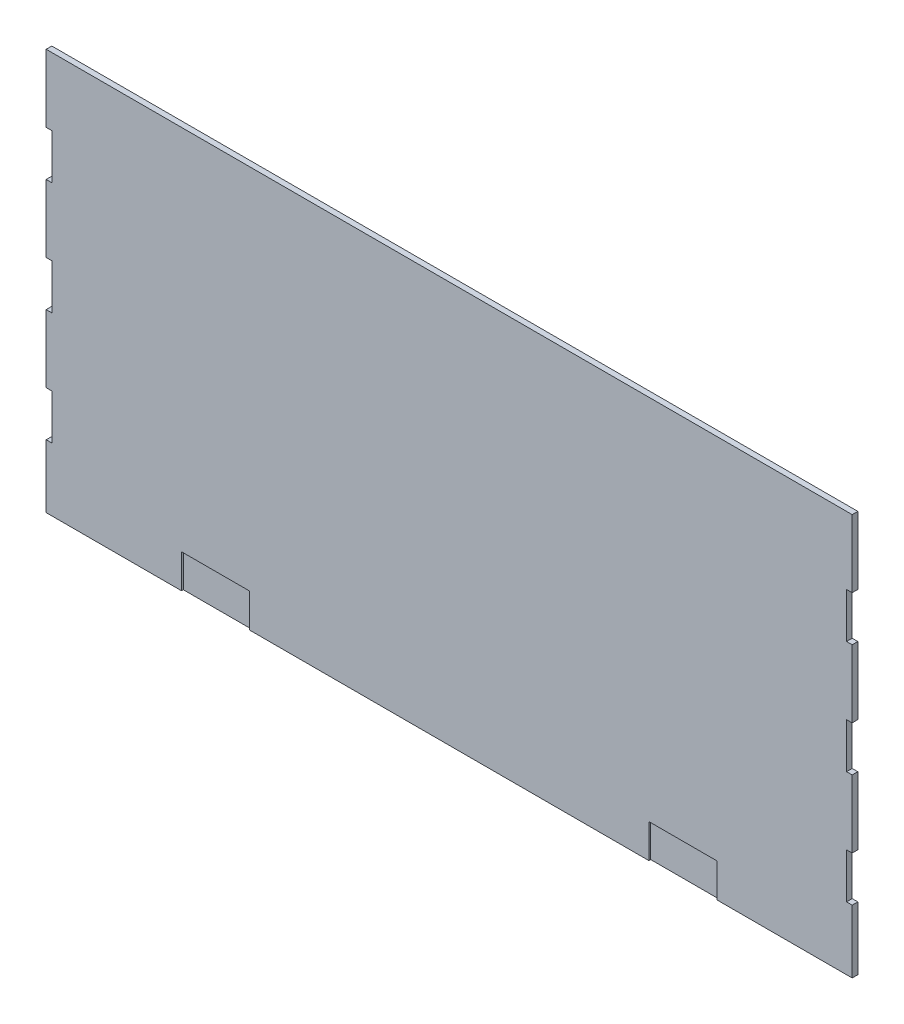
ISO-10303-21;
HEADER;
FILE_DESCRIPTION(('STEP AP214'),'2;1');
FILE_NAME('part.step','',(''),(''),'','','');
FILE_SCHEMA(('AUTOMOTIVE_DESIGN { 1 0 10303 214 1 1 1 1 }'));
ENDSEC;
DATA;
#1=APPLICATION_CONTEXT('core data for automotive mechanical design processes');
#2=APPLICATION_PROTOCOL_DEFINITION('international standard','automotive_design',2000,#1);
#3=PRODUCT_CONTEXT('',#1,'mechanical');
#4=PRODUCT('Part','Part','',(#3));
#5=PRODUCT_RELATED_PRODUCT_CATEGORY('part','',(#4));
#6=PRODUCT_DEFINITION_FORMATION('','',#4);
#7=PRODUCT_DEFINITION_CONTEXT('part definition',#1,'design');
#8=PRODUCT_DEFINITION('design','',#6,#7);
#9=PRODUCT_DEFINITION_SHAPE('','',#8);
#10=(LENGTH_UNIT() NAMED_UNIT(*) SI_UNIT(.MILLI.,.METRE.));
#11=(NAMED_UNIT(*) PLANE_ANGLE_UNIT() SI_UNIT($,.RADIAN.));
#12=(NAMED_UNIT(*) SI_UNIT($,.STERADIAN.) SOLID_ANGLE_UNIT());
#13=UNCERTAINTY_MEASURE_WITH_UNIT(LENGTH_MEASURE(1.E-05),#10,'distance_accuracy_value','');
#14=(GEOMETRIC_REPRESENTATION_CONTEXT(3) GLOBAL_UNCERTAINTY_ASSIGNED_CONTEXT((#13)) GLOBAL_UNIT_ASSIGNED_CONTEXT((#10,
#11,#12)) REPRESENTATION_CONTEXT('',''));
#15=CARTESIAN_POINT('',(0.,0.,0.));
#16=DIRECTION('',(0.,0.,1.));
#17=DIRECTION('',(1.,0.,0.));
#18=AXIS2_PLACEMENT_3D('',#15,#16,#17);
#19=CARTESIAN_POINT('',(0.,0.,3.175));
#20=DIRECTION('',(1.,0.,0.));
#21=DIRECTION('',(0.,0.,-1.));
#22=AXIS2_PLACEMENT_3D('',#19,#20,#21);
#23=PLANE('',#22);
#24=DIRECTION('',(0.,-1.,0.));
#25=VECTOR('',#24,1.);
#26=CARTESIAN_POINT('',(0.,0.,0.));
#27=LINE('',#26,#25);
#28=CARTESIAN_POINT('',(0.,35.56,0.));
#29=VERTEX_POINT('',#28);
#30=CARTESIAN_POINT('',(0.,0.,0.));
#31=VERTEX_POINT('',#30);
#32=EDGE_CURVE('E329',#29,#31,#27,.T.);
#33=ORIENTED_EDGE('',*,*,#32,.T.);
#34=DIRECTION('',(0.,0.,-1.));
#35=VECTOR('',#34,1.);
#36=CARTESIAN_POINT('',(0.,0.,3.175));
#37=LINE('',#36,#35);
#38=CARTESIAN_POINT('',(0.,0.,3.175));
#39=VERTEX_POINT('',#38);
#40=EDGE_CURVE('E11',#39,#31,#37,.T.);
#41=ORIENTED_EDGE('',*,*,#40,.F.);
#42=DIRECTION('',(0.,-1.,0.));
#43=VECTOR('',#42,1.);
#44=CARTESIAN_POINT('',(0.,0.,3.175));
#45=LINE('',#44,#43);
#46=CARTESIAN_POINT('',(0.,35.56,3.175));
#47=VERTEX_POINT('',#46);
#48=EDGE_CURVE('E335',#47,#39,#45,.T.);
#49=ORIENTED_EDGE('',*,*,#48,.F.);
#50=DIRECTION('',(0.,0.,-1.));
#51=VECTOR('',#50,1.);
#52=CARTESIAN_POINT('',(0.,35.56,3.175));
#53=LINE('',#52,#51);
#54=EDGE_CURVE('E396',#47,#29,#53,.T.);
#55=ORIENTED_EDGE('',*,*,#54,.T.);
#56=EDGE_LOOP('',(#33,#41,#49,#55));
#57=FACE_BOUND('',#56,.T.);
#58=ADVANCED_FACE('F35',(#57),#23,.F.);
#59=CARTESIAN_POINT('',(0.,0.,3.175));
#60=DIRECTION('',(0.,1.,0.));
#61=DIRECTION('',(-1.,0.,0.));
#62=AXIS2_PLACEMENT_3D('',#59,#60,#61);
#63=PLANE('',#62);
#64=DIRECTION('',(1.,0.,0.));
#65=VECTOR('',#64,1.);
#66=CARTESIAN_POINT('',(339.471,0.,2.159));
#67=LINE('',#66,#65);
#68=CARTESIAN_POINT('',(339.471,0.,2.159));
#69=VERTEX_POINT('',#68);
#70=CARTESIAN_POINT('',(377.825,0.,2.159));
#71=VERTEX_POINT('',#70);
#72=EDGE_CURVE('E286',#69,#71,#67,.T.);
#73=ORIENTED_EDGE('',*,*,#72,.F.);
#74=DIRECTION('',(0.,0.,1.));
#75=VECTOR('',#74,1.);
#76=CARTESIAN_POINT('',(339.471,0.,2.159));
#77=LINE('',#76,#75);
#78=CARTESIAN_POINT('',(339.471,0.,3.175));
#79=VERTEX_POINT('',#78);
#80=EDGE_CURVE('E269',#69,#79,#77,.T.);
#81=ORIENTED_EDGE('',*,*,#80,.T.);
#82=DIRECTION('',(1.,0.,0.));
#83=VECTOR('',#82,1.);
#84=CARTESIAN_POINT('',(0.,0.,3.175));
#85=LINE('',#84,#83);
#86=CARTESIAN_POINT('',(114.554,0.,3.175));
#87=VERTEX_POINT('',#86);
#88=EDGE_CURVE('E344',#87,#79,#85,.T.);
#89=ORIENTED_EDGE('',*,*,#88,.F.);
#90=DIRECTION('',(0.,0.,1.));
#91=VECTOR('',#90,1.);
#92=CARTESIAN_POINT('',(114.554,0.,2.159));
#93=LINE('',#92,#91);
#94=CARTESIAN_POINT('',(114.554,0.,2.159));
#95=VERTEX_POINT('',#94);
#96=EDGE_CURVE('E57',#95,#87,#93,.T.);
#97=ORIENTED_EDGE('',*,*,#96,.F.);
#98=DIRECTION('',(1.,0.,0.));
#99=VECTOR('',#98,1.);
#100=CARTESIAN_POINT('',(114.554,0.,2.159));
#101=LINE('',#100,#99);
#102=CARTESIAN_POINT('',(76.2,0.,2.159));
#103=VERTEX_POINT('',#102);
#104=EDGE_CURVE('E308',#103,#95,#101,.T.);
#105=ORIENTED_EDGE('',*,*,#104,.F.);
#106=DIRECTION('',(0.,0.,1.));
#107=VECTOR('',#106,1.);
#108=CARTESIAN_POINT('',(76.2,0.,2.159));
#109=LINE('',#108,#107);
#110=CARTESIAN_POINT('',(76.2,0.,3.175));
#111=VERTEX_POINT('',#110);
#112=EDGE_CURVE('E326',#103,#111,#109,.T.);
#113=ORIENTED_EDGE('',*,*,#112,.T.);
#114=EDGE_CURVE('E340',#39,#111,#85,.T.);
#115=ORIENTED_EDGE('',*,*,#114,.F.);
#116=ORIENTED_EDGE('',*,*,#40,.T.);
#117=DIRECTION('',(1.,0.,0.));
#118=VECTOR('',#117,1.);
#119=CARTESIAN_POINT('',(0.,0.,0.));
#120=LINE('',#119,#118);
#121=CARTESIAN_POINT('',(454.025,0.,0.));
#122=VERTEX_POINT('',#121);
#123=EDGE_CURVE('E399',#31,#122,#120,.T.);
#124=ORIENTED_EDGE('',*,*,#123,.T.);
#125=DIRECTION('',(0.,0.,-1.));
#126=VECTOR('',#125,1.);
#127=CARTESIAN_POINT('',(454.025,0.,3.175));
#128=LINE('',#127,#126);
#129=CARTESIAN_POINT('',(454.025,0.,3.175));
#130=VERTEX_POINT('',#129);
#131=EDGE_CURVE('E42',#130,#122,#128,.T.);
#132=ORIENTED_EDGE('',*,*,#131,.F.);
#133=CARTESIAN_POINT('',(377.825,0.,3.175));
#134=VERTEX_POINT('',#133);
#135=EDGE_CURVE('E338',#134,#130,#85,.T.);
#136=ORIENTED_EDGE('',*,*,#135,.F.);
#137=DIRECTION('',(0.,0.,1.));
#138=VECTOR('',#137,1.);
#139=CARTESIAN_POINT('',(377.825,0.,2.159));
#140=LINE('',#139,#138);
#141=EDGE_CURVE('E49',#71,#134,#140,.T.);
#142=ORIENTED_EDGE('',*,*,#141,.F.);
#143=EDGE_LOOP('',(#73,#81,#89,#97,#105,#113,#115,#116,#124,#132,#136,#142));
#144=FACE_BOUND('',#143,.T.);
#145=ADVANCED_FACE('F290',(#144),#63,.F.);
#146=CARTESIAN_POINT('',(454.025,0.,3.175));
#147=DIRECTION('',(-1.,0.,0.));
#148=DIRECTION('',(0.,0.,1.));
#149=AXIS2_PLACEMENT_3D('',#146,#147,#148);
#150=PLANE('',#149);
#151=DIRECTION('',(0.,1.,0.));
#152=VECTOR('',#151,1.);
#153=CARTESIAN_POINT('',(454.025,0.,0.));
#154=LINE('',#153,#152);
#155=CARTESIAN_POINT('',(454.025,35.5600000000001,0.));
#156=VERTEX_POINT('',#155);
#157=EDGE_CURVE('E401',#122,#156,#154,.T.);
#158=ORIENTED_EDGE('',*,*,#157,.T.);
#159=DIRECTION('',(0.,0.,-1.));
#160=VECTOR('',#159,1.);
#161=CARTESIAN_POINT('',(454.025,35.5600000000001,3.175));
#162=LINE('',#161,#160);
#163=CARTESIAN_POINT('',(454.025,35.5600000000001,3.175));
#164=VERTEX_POINT('',#163);
#165=EDGE_CURVE('E526',#164,#156,#162,.T.);
#166=ORIENTED_EDGE('',*,*,#165,.F.);
#167=DIRECTION('',(0.,1.,0.));
#168=VECTOR('',#167,1.);
#169=CARTESIAN_POINT('',(454.025,0.,3.175));
#170=LINE('',#169,#168);
#171=EDGE_CURVE('E343',#130,#164,#170,.T.);
#172=ORIENTED_EDGE('',*,*,#171,.F.);
#173=ORIENTED_EDGE('',*,*,#131,.T.);
#174=EDGE_LOOP('',(#158,#166,#172,#173));
#175=FACE_BOUND('',#174,.T.);
#176=ADVANCED_FACE('F533',(#175),#150,.F.);
#177=CARTESIAN_POINT('',(450.85,35.5600000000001,3.175));
#178=DIRECTION('',(0.,-1.,0.));
#179=DIRECTION('',(0.,0.,-1.));
#180=AXIS2_PLACEMENT_3D('',#177,#178,#179);
#181=PLANE('',#180);
#182=DIRECTION('',(-1.,0.,0.));
#183=VECTOR('',#182,1.);
#184=CARTESIAN_POINT('',(450.85,35.5600000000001,0.));
#185=LINE('',#184,#183);
#186=CARTESIAN_POINT('',(450.85,35.5600000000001,0.));
#187=VERTEX_POINT('',#186);
#188=EDGE_CURVE('E403',#156,#187,#185,.T.);
#189=ORIENTED_EDGE('',*,*,#188,.T.);
#190=DIRECTION('',(0.,0.,-1.));
#191=VECTOR('',#190,1.);
#192=CARTESIAN_POINT('',(450.85,35.5600000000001,3.175));
#193=LINE('',#192,#191);
#194=CARTESIAN_POINT('',(450.85,35.5600000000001,3.175));
#195=VERTEX_POINT('',#194);
#196=EDGE_CURVE('E523',#195,#187,#193,.T.);
#197=ORIENTED_EDGE('',*,*,#196,.F.);
#198=DIRECTION('',(-1.,0.,0.));
#199=VECTOR('',#198,1.);
#200=CARTESIAN_POINT('',(450.85,35.5600000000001,3.175));
#201=LINE('',#200,#199);
#202=EDGE_CURVE('E346',#164,#195,#201,.T.);
#203=ORIENTED_EDGE('',*,*,#202,.F.);
#204=ORIENTED_EDGE('',*,*,#165,.T.);
#205=EDGE_LOOP('',(#189,#197,#203,#204));
#206=FACE_BOUND('',#205,.T.);
#207=ADVANCED_FACE('F543',(#206),#181,.F.);
#208=CARTESIAN_POINT('',(450.85,60.9600000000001,3.175));
#209=DIRECTION('',(-1.,0.,0.));
#210=DIRECTION('',(0.,0.,1.));
#211=AXIS2_PLACEMENT_3D('',#208,#209,#210);
#212=PLANE('',#211);
#213=DIRECTION('',(0.,1.,0.));
#214=VECTOR('',#213,1.);
#215=CARTESIAN_POINT('',(450.85,60.9600000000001,0.));
#216=LINE('',#215,#214);
#217=CARTESIAN_POINT('',(450.85,60.9600000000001,0.));
#218=VERTEX_POINT('',#217);
#219=EDGE_CURVE('E405',#187,#218,#216,.T.);
#220=ORIENTED_EDGE('',*,*,#219,.T.);
#221=DIRECTION('',(0.,0.,-1.));
#222=VECTOR('',#221,1.);
#223=CARTESIAN_POINT('',(450.85,60.9600000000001,3.175));
#224=LINE('',#223,#222);
#225=CARTESIAN_POINT('',(450.85,60.9600000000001,3.175));
#226=VERTEX_POINT('',#225);
#227=EDGE_CURVE('E520',#226,#218,#224,.T.);
#228=ORIENTED_EDGE('',*,*,#227,.F.);
#229=DIRECTION('',(0.,1.,0.));
#230=VECTOR('',#229,1.);
#231=CARTESIAN_POINT('',(450.85,60.9600000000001,3.175));
#232=LINE('',#231,#230);
#233=EDGE_CURVE('E348',#195,#226,#232,.T.);
#234=ORIENTED_EDGE('',*,*,#233,.F.);
#235=ORIENTED_EDGE('',*,*,#196,.T.);
#236=EDGE_LOOP('',(#220,#228,#234,#235));
#237=FACE_BOUND('',#236,.T.);
#238=ADVANCED_FACE('F547',(#237),#212,.F.);
#239=CARTESIAN_POINT('',(454.025,60.9600000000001,3.175));
#240=DIRECTION('',(0.,1.,0.));
#241=DIRECTION('',(0.,0.,1.));
#242=AXIS2_PLACEMENT_3D('',#239,#240,#241);
#243=PLANE('',#242);
#244=DIRECTION('',(1.,0.,0.));
#245=VECTOR('',#244,1.);
#246=CARTESIAN_POINT('',(454.025,60.9600000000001,0.));
#247=LINE('',#246,#245);
#248=CARTESIAN_POINT('',(454.025,60.9600000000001,0.));
#249=VERTEX_POINT('',#248);
#250=EDGE_CURVE('E407',#218,#249,#247,.T.);
#251=ORIENTED_EDGE('',*,*,#250,.T.);
#252=DIRECTION('',(0.,0.,-1.));
#253=VECTOR('',#252,1.);
#254=CARTESIAN_POINT('',(454.025,60.9600000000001,3.175));
#255=LINE('',#254,#253);
#256=CARTESIAN_POINT('',(454.025,60.9600000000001,3.175));
#257=VERTEX_POINT('',#256);
#258=EDGE_CURVE('E517',#257,#249,#255,.T.);
#259=ORIENTED_EDGE('',*,*,#258,.F.);
#260=DIRECTION('',(1.,0.,0.));
#261=VECTOR('',#260,1.);
#262=CARTESIAN_POINT('',(454.025,60.9600000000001,3.175));
#263=LINE('',#262,#261);
#264=EDGE_CURVE('E350',#226,#257,#263,.T.);
#265=ORIENTED_EDGE('',*,*,#264,.F.);
#266=ORIENTED_EDGE('',*,*,#227,.T.);
#267=EDGE_LOOP('',(#251,#259,#265,#266));
#268=FACE_BOUND('',#267,.T.);
#269=ADVANCED_FACE('F677',(#268),#243,.F.);
#270=CARTESIAN_POINT('',(454.025,60.9600000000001,3.175));
#271=DIRECTION('',(-1.,0.,0.));
#272=DIRECTION('',(0.,0.,1.));
#273=AXIS2_PLACEMENT_3D('',#270,#271,#272);
#274=PLANE('',#273);
#275=DIRECTION('',(0.,1.,0.));
#276=VECTOR('',#275,1.);
#277=CARTESIAN_POINT('',(454.025,60.9600000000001,0.));
#278=LINE('',#277,#276);
#279=CARTESIAN_POINT('',(454.025,99.0600000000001,0.));
#280=VERTEX_POINT('',#279);
#281=EDGE_CURVE('E409',#249,#280,#278,.T.);
#282=ORIENTED_EDGE('',*,*,#281,.T.);
#283=DIRECTION('',(0.,0.,-1.));
#284=VECTOR('',#283,1.);
#285=CARTESIAN_POINT('',(454.025,99.0600000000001,3.175));
#286=LINE('',#285,#284);
#287=CARTESIAN_POINT('',(454.025,99.0600000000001,3.175));
#288=VERTEX_POINT('',#287);
#289=EDGE_CURVE('E514',#288,#280,#286,.T.);
#290=ORIENTED_EDGE('',*,*,#289,.F.);
#291=DIRECTION('',(0.,1.,0.));
#292=VECTOR('',#291,1.);
#293=CARTESIAN_POINT('',(454.025,60.9600000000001,3.175));
#294=LINE('',#293,#292);
#295=EDGE_CURVE('E352',#257,#288,#294,.T.);
#296=ORIENTED_EDGE('',*,*,#295,.F.);
#297=ORIENTED_EDGE('',*,*,#258,.T.);
#298=EDGE_LOOP('',(#282,#290,#296,#297));
#299=FACE_BOUND('',#298,.T.);
#300=ADVANCED_FACE('F674',(#299),#274,.F.);
#301=CARTESIAN_POINT('',(450.85,99.0600000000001,3.175));
#302=DIRECTION('',(0.,-1.,0.));
#303=DIRECTION('',(0.,0.,-1.));
#304=AXIS2_PLACEMENT_3D('',#301,#302,#303);
#305=PLANE('',#304);
#306=DIRECTION('',(-1.,0.,0.));
#307=VECTOR('',#306,1.);
#308=CARTESIAN_POINT('',(450.85,99.0600000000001,0.));
#309=LINE('',#308,#307);
#310=CARTESIAN_POINT('',(450.85,99.0600000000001,0.));
#311=VERTEX_POINT('',#310);
#312=EDGE_CURVE('E411',#280,#311,#309,.T.);
#313=ORIENTED_EDGE('',*,*,#312,.T.);
#314=DIRECTION('',(0.,0.,-1.));
#315=VECTOR('',#314,1.);
#316=CARTESIAN_POINT('',(450.85,99.0600000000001,3.175));
#317=LINE('',#316,#315);
#318=CARTESIAN_POINT('',(450.85,99.0600000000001,3.175));
#319=VERTEX_POINT('',#318);
#320=EDGE_CURVE('E511',#319,#311,#317,.T.);
#321=ORIENTED_EDGE('',*,*,#320,.F.);
#322=DIRECTION('',(-1.,0.,0.));
#323=VECTOR('',#322,1.);
#324=CARTESIAN_POINT('',(450.85,99.0600000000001,3.175));
#325=LINE('',#324,#323);
#326=EDGE_CURVE('E354',#288,#319,#325,.T.);
#327=ORIENTED_EDGE('',*,*,#326,.F.);
#328=ORIENTED_EDGE('',*,*,#289,.T.);
#329=EDGE_LOOP('',(#313,#321,#327,#328));
#330=FACE_BOUND('',#329,.T.);
#331=ADVANCED_FACE('F670',(#330),#305,.F.);
#332=CARTESIAN_POINT('',(450.85,124.46,3.175));
#333=DIRECTION('',(-1.,0.,0.));
#334=DIRECTION('',(0.,-1.,0.));
#335=AXIS2_PLACEMENT_3D('',#332,#333,#334);
#336=PLANE('',#335);
#337=DIRECTION('',(0.,1.,0.));
#338=VECTOR('',#337,1.);
#339=CARTESIAN_POINT('',(450.85,124.46,0.));
#340=LINE('',#339,#338);
#341=CARTESIAN_POINT('',(450.85,124.46,0.));
#342=VERTEX_POINT('',#341);
#343=EDGE_CURVE('E413',#311,#342,#340,.T.);
#344=ORIENTED_EDGE('',*,*,#343,.T.);
#345=DIRECTION('',(0.,0.,-1.));
#346=VECTOR('',#345,1.);
#347=CARTESIAN_POINT('',(450.85,124.46,3.175));
#348=LINE('',#347,#346);
#349=CARTESIAN_POINT('',(450.85,124.46,3.175));
#350=VERTEX_POINT('',#349);
#351=EDGE_CURVE('E508',#350,#342,#348,.T.);
#352=ORIENTED_EDGE('',*,*,#351,.F.);
#353=DIRECTION('',(0.,1.,0.));
#354=VECTOR('',#353,1.);
#355=CARTESIAN_POINT('',(450.85,124.46,3.175));
#356=LINE('',#355,#354);
#357=EDGE_CURVE('E356',#319,#350,#356,.T.);
#358=ORIENTED_EDGE('',*,*,#357,.F.);
#359=ORIENTED_EDGE('',*,*,#320,.T.);
#360=EDGE_LOOP('',(#344,#352,#358,#359));
#361=FACE_BOUND('',#360,.T.);
#362=ADVANCED_FACE('F666',(#361),#336,.F.);
#363=CARTESIAN_POINT('',(454.025,124.46,3.175));
#364=DIRECTION('',(0.,1.,0.));
#365=DIRECTION('',(0.,0.,1.));
#366=AXIS2_PLACEMENT_3D('',#363,#364,#365);
#367=PLANE('',#366);
#368=DIRECTION('',(1.,0.,0.));
#369=VECTOR('',#368,1.);
#370=CARTESIAN_POINT('',(454.025,124.46,0.));
#371=LINE('',#370,#369);
#372=CARTESIAN_POINT('',(454.025,124.46,0.));
#373=VERTEX_POINT('',#372);
#374=EDGE_CURVE('E415',#342,#373,#371,.T.);
#375=ORIENTED_EDGE('',*,*,#374,.T.);
#376=DIRECTION('',(0.,0.,-1.));
#377=VECTOR('',#376,1.);
#378=CARTESIAN_POINT('',(454.025,124.46,3.175));
#379=LINE('',#378,#377);
#380=CARTESIAN_POINT('',(454.025,124.46,3.175));
#381=VERTEX_POINT('',#380);
#382=EDGE_CURVE('E505',#381,#373,#379,.T.);
#383=ORIENTED_EDGE('',*,*,#382,.F.);
#384=DIRECTION('',(1.,0.,0.));
#385=VECTOR('',#384,1.);
#386=CARTESIAN_POINT('',(454.025,124.46,3.175));
#387=LINE('',#386,#385);
#388=EDGE_CURVE('E358',#350,#381,#387,.T.);
#389=ORIENTED_EDGE('',*,*,#388,.F.);
#390=ORIENTED_EDGE('',*,*,#351,.T.);
#391=EDGE_LOOP('',(#375,#383,#389,#390));
#392=FACE_BOUND('',#391,.T.);
#393=ADVANCED_FACE('F661',(#392),#367,.F.);
#394=CARTESIAN_POINT('',(454.025,124.46,3.175));
#395=DIRECTION('',(-1.,0.,0.));
#396=DIRECTION('',(0.,0.,1.));
#397=AXIS2_PLACEMENT_3D('',#394,#395,#396);
#398=PLANE('',#397);
#399=DIRECTION('',(0.,1.,0.));
#400=VECTOR('',#399,1.);
#401=CARTESIAN_POINT('',(454.025,124.46,0.));
#402=LINE('',#401,#400);
#403=CARTESIAN_POINT('',(454.025,162.56,0.));
#404=VERTEX_POINT('',#403);
#405=EDGE_CURVE('E417',#373,#404,#402,.T.);
#406=ORIENTED_EDGE('',*,*,#405,.T.);
#407=DIRECTION('',(0.,0.,-1.));
#408=VECTOR('',#407,1.);
#409=CARTESIAN_POINT('',(454.025,162.56,3.175));
#410=LINE('',#409,#408);
#411=CARTESIAN_POINT('',(454.025,162.56,3.175));
#412=VERTEX_POINT('',#411);
#413=EDGE_CURVE('E502',#412,#404,#410,.T.);
#414=ORIENTED_EDGE('',*,*,#413,.F.);
#415=DIRECTION('',(0.,1.,0.));
#416=VECTOR('',#415,1.);
#417=CARTESIAN_POINT('',(454.025,124.46,3.175));
#418=LINE('',#417,#416);
#419=EDGE_CURVE('E360',#381,#412,#418,.T.);
#420=ORIENTED_EDGE('',*,*,#419,.F.);
#421=ORIENTED_EDGE('',*,*,#382,.T.);
#422=EDGE_LOOP('',(#406,#414,#420,#421));
#423=FACE_BOUND('',#422,.T.);
#424=ADVANCED_FACE('F655',(#423),#398,.F.);
#425=CARTESIAN_POINT('',(450.85,162.56,3.175));
#426=DIRECTION('',(0.,-1.,0.));
#427=DIRECTION('',(0.,0.,-1.));
#428=AXIS2_PLACEMENT_3D('',#425,#426,#427);
#429=PLANE('',#428);
#430=DIRECTION('',(-1.,0.,0.));
#431=VECTOR('',#430,1.);
#432=CARTESIAN_POINT('',(450.85,162.56,0.));
#433=LINE('',#432,#431);
#434=CARTESIAN_POINT('',(450.85,162.56,0.));
#435=VERTEX_POINT('',#434);
#436=EDGE_CURVE('E419',#404,#435,#433,.T.);
#437=ORIENTED_EDGE('',*,*,#436,.T.);
#438=DIRECTION('',(0.,0.,-1.));
#439=VECTOR('',#438,1.);
#440=CARTESIAN_POINT('',(450.85,162.56,3.175));
#441=LINE('',#440,#439);
#442=CARTESIAN_POINT('',(450.85,162.56,3.175));
#443=VERTEX_POINT('',#442);
#444=EDGE_CURVE('E499',#443,#435,#441,.T.);
#445=ORIENTED_EDGE('',*,*,#444,.F.);
#446=DIRECTION('',(-1.,0.,0.));
#447=VECTOR('',#446,1.);
#448=CARTESIAN_POINT('',(450.85,162.56,3.175));
#449=LINE('',#448,#447);
#450=EDGE_CURVE('E362',#412,#443,#449,.T.);
#451=ORIENTED_EDGE('',*,*,#450,.F.);
#452=ORIENTED_EDGE('',*,*,#413,.T.);
#453=EDGE_LOOP('',(#437,#445,#451,#452));
#454=FACE_BOUND('',#453,.T.);
#455=ADVANCED_FACE('F651',(#454),#429,.F.);
#456=CARTESIAN_POINT('',(450.85,187.96,3.175));
#457=DIRECTION('',(-1.,0.,0.));
#458=DIRECTION('',(0.,0.,1.));
#459=AXIS2_PLACEMENT_3D('',#456,#457,#458);
#460=PLANE('',#459);
#461=DIRECTION('',(0.,1.,0.));
#462=VECTOR('',#461,1.);
#463=CARTESIAN_POINT('',(450.85,187.96,0.));
#464=LINE('',#463,#462);
#465=CARTESIAN_POINT('',(450.85,187.96,0.));
#466=VERTEX_POINT('',#465);
#467=EDGE_CURVE('E421',#435,#466,#464,.T.);
#468=ORIENTED_EDGE('',*,*,#467,.T.);
#469=DIRECTION('',(0.,0.,-1.));
#470=VECTOR('',#469,1.);
#471=CARTESIAN_POINT('',(450.85,187.96,3.175));
#472=LINE('',#471,#470);
#473=CARTESIAN_POINT('',(450.85,187.96,3.175));
#474=VERTEX_POINT('',#473);
#475=EDGE_CURVE('E496',#474,#466,#472,.T.);
#476=ORIENTED_EDGE('',*,*,#475,.F.);
#477=DIRECTION('',(0.,1.,0.));
#478=VECTOR('',#477,1.);
#479=CARTESIAN_POINT('',(450.85,187.96,3.175));
#480=LINE('',#479,#478);
#481=EDGE_CURVE('E364',#443,#474,#480,.T.);
#482=ORIENTED_EDGE('',*,*,#481,.F.);
#483=ORIENTED_EDGE('',*,*,#444,.T.);
#484=EDGE_LOOP('',(#468,#476,#482,#483));
#485=FACE_BOUND('',#484,.T.);
#486=ADVANCED_FACE('F646',(#485),#460,.F.);
#487=CARTESIAN_POINT('',(454.025,187.96,3.175));
#488=DIRECTION('',(0.,1.,0.));
#489=DIRECTION('',(0.,0.,1.));
#490=AXIS2_PLACEMENT_3D('',#487,#488,#489);
#491=PLANE('',#490);
#492=DIRECTION('',(1.,0.,0.));
#493=VECTOR('',#492,1.);
#494=CARTESIAN_POINT('',(454.025,187.96,0.));
#495=LINE('',#494,#493);
#496=CARTESIAN_POINT('',(454.025,187.96,0.));
#497=VERTEX_POINT('',#496);
#498=EDGE_CURVE('E423',#466,#497,#495,.T.);
#499=ORIENTED_EDGE('',*,*,#498,.T.);
#500=DIRECTION('',(0.,0.,-1.));
#501=VECTOR('',#500,1.);
#502=CARTESIAN_POINT('',(454.025,187.96,3.175));
#503=LINE('',#502,#501);
#504=CARTESIAN_POINT('',(454.025,187.96,3.175));
#505=VERTEX_POINT('',#504);
#506=EDGE_CURVE('E493',#505,#497,#503,.T.);
#507=ORIENTED_EDGE('',*,*,#506,.F.);
#508=DIRECTION('',(1.,0.,0.));
#509=VECTOR('',#508,1.);
#510=CARTESIAN_POINT('',(454.025,187.96,3.175));
#511=LINE('',#510,#509);
#512=EDGE_CURVE('E366',#474,#505,#511,.T.);
#513=ORIENTED_EDGE('',*,*,#512,.F.);
#514=ORIENTED_EDGE('',*,*,#475,.T.);
#515=EDGE_LOOP('',(#499,#507,#513,#514));
#516=FACE_BOUND('',#515,.T.);
#517=ADVANCED_FACE('F640',(#516),#491,.F.);
#518=CARTESIAN_POINT('',(454.025,187.96,3.175));
#519=DIRECTION('',(-1.,0.,0.));
#520=DIRECTION('',(0.,0.,1.));
#521=AXIS2_PLACEMENT_3D('',#518,#519,#520);
#522=PLANE('',#521);
#523=DIRECTION('',(0.,1.,0.));
#524=VECTOR('',#523,1.);
#525=CARTESIAN_POINT('',(454.025,187.96,0.));
#526=LINE('',#525,#524);
#527=CARTESIAN_POINT('',(454.025,226.06,0.));
#528=VERTEX_POINT('',#527);
#529=EDGE_CURVE('E425',#497,#528,#526,.T.);
#530=ORIENTED_EDGE('',*,*,#529,.T.);
#531=DIRECTION('',(0.,0.,-1.));
#532=VECTOR('',#531,1.);
#533=CARTESIAN_POINT('',(454.025,226.06,3.175));
#534=LINE('',#533,#532);
#535=CARTESIAN_POINT('',(454.025,226.06,3.175));
#536=VERTEX_POINT('',#535);
#537=EDGE_CURVE('E490',#536,#528,#534,.T.);
#538=ORIENTED_EDGE('',*,*,#537,.F.);
#539=DIRECTION('',(0.,1.,0.));
#540=VECTOR('',#539,1.);
#541=CARTESIAN_POINT('',(454.025,187.96,3.175));
#542=LINE('',#541,#540);
#543=EDGE_CURVE('E368',#505,#536,#542,.T.);
#544=ORIENTED_EDGE('',*,*,#543,.F.);
#545=ORIENTED_EDGE('',*,*,#506,.T.);
#546=EDGE_LOOP('',(#530,#538,#544,#545));
#547=FACE_BOUND('',#546,.T.);
#548=ADVANCED_FACE('F636',(#547),#522,.F.);
#549=CARTESIAN_POINT('',(0.,226.06,3.175));
#550=DIRECTION('',(0.,-1.,0.));
#551=DIRECTION('',(1.,0.,0.));
#552=AXIS2_PLACEMENT_3D('',#549,#550,#551);
#553=PLANE('',#552);
#554=DIRECTION('',(-1.,0.,0.));
#555=VECTOR('',#554,1.);
#556=CARTESIAN_POINT('',(0.,226.06,0.));
#557=LINE('',#556,#555);
#558=CARTESIAN_POINT('',(0.,226.06,0.));
#559=VERTEX_POINT('',#558);
#560=EDGE_CURVE('E427',#528,#559,#557,.T.);
#561=ORIENTED_EDGE('',*,*,#560,.T.);
#562=DIRECTION('',(0.,0.,-1.));
#563=VECTOR('',#562,1.);
#564=CARTESIAN_POINT('',(0.,226.06,3.175));
#565=LINE('',#564,#563);
#566=CARTESIAN_POINT('',(0.,226.06,3.175));
#567=VERTEX_POINT('',#566);
#568=EDGE_CURVE('E487',#567,#559,#565,.T.);
#569=ORIENTED_EDGE('',*,*,#568,.F.);
#570=DIRECTION('',(-1.,0.,0.));
#571=VECTOR('',#570,1.);
#572=CARTESIAN_POINT('',(0.,226.06,3.175));
#573=LINE('',#572,#571);
#574=EDGE_CURVE('E370',#536,#567,#573,.T.);
#575=ORIENTED_EDGE('',*,*,#574,.F.);
#576=ORIENTED_EDGE('',*,*,#537,.T.);
#577=EDGE_LOOP('',(#561,#569,#575,#576));
#578=FACE_BOUND('',#577,.T.);
#579=ADVANCED_FACE('F631',(#578),#553,.F.);
#580=CARTESIAN_POINT('',(0.,187.96,3.175));
#581=DIRECTION('',(1.,0.,0.));
#582=DIRECTION('',(0.,1.,0.));
#583=AXIS2_PLACEMENT_3D('',#580,#581,#582);
#584=PLANE('',#583);
#585=DIRECTION('',(0.,-1.,0.));
#586=VECTOR('',#585,1.);
#587=CARTESIAN_POINT('',(0.,187.96,0.));
#588=LINE('',#587,#586);
#589=CARTESIAN_POINT('',(0.,187.96,0.));
#590=VERTEX_POINT('',#589);
#591=EDGE_CURVE('E429',#559,#590,#588,.T.);
#592=ORIENTED_EDGE('',*,*,#591,.T.);
#593=DIRECTION('',(0.,0.,-1.));
#594=VECTOR('',#593,1.);
#595=CARTESIAN_POINT('',(0.,187.96,3.175));
#596=LINE('',#595,#594);
#597=CARTESIAN_POINT('',(0.,187.96,3.175));
#598=VERTEX_POINT('',#597);
#599=EDGE_CURVE('E484',#598,#590,#596,.T.);
#600=ORIENTED_EDGE('',*,*,#599,.F.);
#601=DIRECTION('',(0.,-1.,0.));
#602=VECTOR('',#601,1.);
#603=CARTESIAN_POINT('',(0.,187.96,3.175));
#604=LINE('',#603,#602);
#605=EDGE_CURVE('E372',#567,#598,#604,.T.);
#606=ORIENTED_EDGE('',*,*,#605,.F.);
#607=ORIENTED_EDGE('',*,*,#568,.T.);
#608=EDGE_LOOP('',(#592,#600,#606,#607));
#609=FACE_BOUND('',#608,.T.);
#610=ADVANCED_FACE('F625',(#609),#584,.F.);
#611=CARTESIAN_POINT('',(0.,187.96,3.175));
#612=DIRECTION('',(0.,1.,0.));
#613=DIRECTION('',(0.,0.,1.));
#614=AXIS2_PLACEMENT_3D('',#611,#612,#613);
#615=PLANE('',#614);
#616=DIRECTION('',(1.,0.,0.));
#617=VECTOR('',#616,1.);
#618=CARTESIAN_POINT('',(0.,187.96,0.));
#619=LINE('',#618,#617);
#620=CARTESIAN_POINT('',(3.175,187.96,0.));
#621=VERTEX_POINT('',#620);
#622=EDGE_CURVE('E431',#590,#621,#619,.T.);
#623=ORIENTED_EDGE('',*,*,#622,.T.);
#624=DIRECTION('',(0.,0.,-1.));
#625=VECTOR('',#624,1.);
#626=CARTESIAN_POINT('',(3.175,187.96,3.175));
#627=LINE('',#626,#625);
#628=CARTESIAN_POINT('',(3.175,187.96,3.175));
#629=VERTEX_POINT('',#628);
#630=EDGE_CURVE('E481',#629,#621,#627,.T.);
#631=ORIENTED_EDGE('',*,*,#630,.F.);
#632=DIRECTION('',(1.,0.,0.));
#633=VECTOR('',#632,1.);
#634=CARTESIAN_POINT('',(0.,187.96,3.175));
#635=LINE('',#634,#633);
#636=EDGE_CURVE('E374',#598,#629,#635,.T.);
#637=ORIENTED_EDGE('',*,*,#636,.F.);
#638=ORIENTED_EDGE('',*,*,#599,.T.);
#639=EDGE_LOOP('',(#623,#631,#637,#638));
#640=FACE_BOUND('',#639,.T.);
#641=ADVANCED_FACE('F621',(#640),#615,.F.);
#642=CARTESIAN_POINT('',(3.175,187.96,3.175));
#643=DIRECTION('',(1.,0.,0.));
#644=DIRECTION('',(0.,1.,0.));
#645=AXIS2_PLACEMENT_3D('',#642,#643,#644);
#646=PLANE('',#645);
#647=DIRECTION('',(0.,-1.,0.));
#648=VECTOR('',#647,1.);
#649=CARTESIAN_POINT('',(3.175,187.96,0.));
#650=LINE('',#649,#648);
#651=CARTESIAN_POINT('',(3.17500000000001,162.56,0.));
#652=VERTEX_POINT('',#651);
#653=EDGE_CURVE('E433',#621,#652,#650,.T.);
#654=ORIENTED_EDGE('',*,*,#653,.T.);
#655=DIRECTION('',(0.,0.,-1.));
#656=VECTOR('',#655,1.);
#657=CARTESIAN_POINT('',(3.17500000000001,162.56,3.175));
#658=LINE('',#657,#656);
#659=CARTESIAN_POINT('',(3.17500000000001,162.56,3.175));
#660=VERTEX_POINT('',#659);
#661=EDGE_CURVE('E478',#660,#652,#658,.T.);
#662=ORIENTED_EDGE('',*,*,#661,.F.);
#663=DIRECTION('',(0.,-1.,0.));
#664=VECTOR('',#663,1.);
#665=CARTESIAN_POINT('',(3.175,187.96,3.175));
#666=LINE('',#665,#664);
#667=EDGE_CURVE('E376',#629,#660,#666,.T.);
#668=ORIENTED_EDGE('',*,*,#667,.F.);
#669=ORIENTED_EDGE('',*,*,#630,.T.);
#670=EDGE_LOOP('',(#654,#662,#668,#669));
#671=FACE_BOUND('',#670,.T.);
#672=ADVANCED_FACE('F616',(#671),#646,.F.);
#673=CARTESIAN_POINT('',(3.17500000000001,162.56,3.175));
#674=DIRECTION('',(0.,-1.,0.));
#675=DIRECTION('',(0.,0.,-1.));
#676=AXIS2_PLACEMENT_3D('',#673,#674,#675);
#677=PLANE('',#676);
#678=DIRECTION('',(-1.,0.,0.));
#679=VECTOR('',#678,1.);
#680=CARTESIAN_POINT('',(3.17500000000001,162.56,0.));
#681=LINE('',#680,#679);
#682=CARTESIAN_POINT('',(0.,162.56,0.));
#683=VERTEX_POINT('',#682);
#684=EDGE_CURVE('E435',#652,#683,#681,.T.);
#685=ORIENTED_EDGE('',*,*,#684,.T.);
#686=DIRECTION('',(0.,0.,-1.));
#687=VECTOR('',#686,1.);
#688=CARTESIAN_POINT('',(0.,162.56,3.175));
#689=LINE('',#688,#687);
#690=CARTESIAN_POINT('',(0.,162.56,3.175));
#691=VERTEX_POINT('',#690);
#692=EDGE_CURVE('E475',#691,#683,#689,.T.);
#693=ORIENTED_EDGE('',*,*,#692,.F.);
#694=DIRECTION('',(-1.,0.,0.));
#695=VECTOR('',#694,1.);
#696=CARTESIAN_POINT('',(3.17500000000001,162.56,3.175));
#697=LINE('',#696,#695);
#698=EDGE_CURVE('E378',#660,#691,#697,.T.);
#699=ORIENTED_EDGE('',*,*,#698,.F.);
#700=ORIENTED_EDGE('',*,*,#661,.T.);
#701=EDGE_LOOP('',(#685,#693,#699,#700));
#702=FACE_BOUND('',#701,.T.);
#703=ADVANCED_FACE('F610',(#702),#677,.F.);
#704=CARTESIAN_POINT('',(0.,124.46,3.175));
#705=DIRECTION('',(1.,0.,0.));
#706=DIRECTION('',(0.,1.,0.));
#707=AXIS2_PLACEMENT_3D('',#704,#705,#706);
#708=PLANE('',#707);
#709=DIRECTION('',(0.,-1.,0.));
#710=VECTOR('',#709,1.);
#711=CARTESIAN_POINT('',(0.,124.46,0.));
#712=LINE('',#711,#710);
#713=CARTESIAN_POINT('',(0.,124.46,0.));
#714=VERTEX_POINT('',#713);
#715=EDGE_CURVE('E437',#683,#714,#712,.T.);
#716=ORIENTED_EDGE('',*,*,#715,.T.);
#717=DIRECTION('',(0.,0.,-1.));
#718=VECTOR('',#717,1.);
#719=CARTESIAN_POINT('',(0.,124.46,3.175));
#720=LINE('',#719,#718);
#721=CARTESIAN_POINT('',(0.,124.46,3.175));
#722=VERTEX_POINT('',#721);
#723=EDGE_CURVE('E472',#722,#714,#720,.T.);
#724=ORIENTED_EDGE('',*,*,#723,.F.);
#725=DIRECTION('',(0.,-1.,0.));
#726=VECTOR('',#725,1.);
#727=CARTESIAN_POINT('',(0.,124.46,3.175));
#728=LINE('',#727,#726);
#729=EDGE_CURVE('E380',#691,#722,#728,.T.);
#730=ORIENTED_EDGE('',*,*,#729,.F.);
#731=ORIENTED_EDGE('',*,*,#692,.T.);
#732=EDGE_LOOP('',(#716,#724,#730,#731));
#733=FACE_BOUND('',#732,.T.);
#734=ADVANCED_FACE('F606',(#733),#708,.F.);
#735=CARTESIAN_POINT('',(0.,124.46,3.175));
#736=DIRECTION('',(0.,1.,0.));
#737=DIRECTION('',(0.,0.,1.));
#738=AXIS2_PLACEMENT_3D('',#735,#736,#737);
#739=PLANE('',#738);
#740=DIRECTION('',(1.,0.,0.));
#741=VECTOR('',#740,1.);
#742=CARTESIAN_POINT('',(0.,124.46,0.));
#743=LINE('',#742,#741);
#744=CARTESIAN_POINT('',(3.17500000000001,124.46,0.));
#745=VERTEX_POINT('',#744);
#746=EDGE_CURVE('E439',#714,#745,#743,.T.);
#747=ORIENTED_EDGE('',*,*,#746,.T.);
#748=DIRECTION('',(0.,0.,-1.));
#749=VECTOR('',#748,1.);
#750=CARTESIAN_POINT('',(3.17500000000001,124.46,3.175));
#751=LINE('',#750,#749);
#752=CARTESIAN_POINT('',(3.17500000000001,124.46,3.175));
#753=VERTEX_POINT('',#752);
#754=EDGE_CURVE('E469',#753,#745,#751,.T.);
#755=ORIENTED_EDGE('',*,*,#754,.F.);
#756=DIRECTION('',(1.,0.,0.));
#757=VECTOR('',#756,1.);
#758=CARTESIAN_POINT('',(0.,124.46,3.175));
#759=LINE('',#758,#757);
#760=EDGE_CURVE('E382',#722,#753,#759,.T.);
#761=ORIENTED_EDGE('',*,*,#760,.F.);
#762=ORIENTED_EDGE('',*,*,#723,.T.);
#763=EDGE_LOOP('',(#747,#755,#761,#762));
#764=FACE_BOUND('',#763,.T.);
#765=ADVANCED_FACE('F601',(#764),#739,.F.);
#766=CARTESIAN_POINT('',(3.17500000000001,124.46,3.175));
#767=DIRECTION('',(1.,0.,0.));
#768=DIRECTION('',(0.,1.,0.));
#769=AXIS2_PLACEMENT_3D('',#766,#767,#768);
#770=PLANE('',#769);
#771=DIRECTION('',(0.,-1.,0.));
#772=VECTOR('',#771,1.);
#773=CARTESIAN_POINT('',(3.17500000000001,124.46,0.));
#774=LINE('',#773,#772);
#775=CARTESIAN_POINT('',(3.17500000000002,99.06,0.));
#776=VERTEX_POINT('',#775);
#777=EDGE_CURVE('E441',#745,#776,#774,.T.);
#778=ORIENTED_EDGE('',*,*,#777,.T.);
#779=DIRECTION('',(0.,0.,-1.));
#780=VECTOR('',#779,1.);
#781=CARTESIAN_POINT('',(3.17500000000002,99.06,3.175));
#782=LINE('',#781,#780);
#783=CARTESIAN_POINT('',(3.17500000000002,99.06,3.175));
#784=VERTEX_POINT('',#783);
#785=EDGE_CURVE('E466',#784,#776,#782,.T.);
#786=ORIENTED_EDGE('',*,*,#785,.F.);
#787=DIRECTION('',(0.,-1.,0.));
#788=VECTOR('',#787,1.);
#789=CARTESIAN_POINT('',(3.17500000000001,124.46,3.175));
#790=LINE('',#789,#788);
#791=EDGE_CURVE('E384',#753,#784,#790,.T.);
#792=ORIENTED_EDGE('',*,*,#791,.F.);
#793=ORIENTED_EDGE('',*,*,#754,.T.);
#794=EDGE_LOOP('',(#778,#786,#792,#793));
#795=FACE_BOUND('',#794,.T.);
#796=ADVANCED_FACE('F595',(#795),#770,.F.);
#797=CARTESIAN_POINT('',(3.17500000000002,99.06,3.175));
#798=DIRECTION('',(0.,-1.,0.));
#799=DIRECTION('',(0.,0.,-1.));
#800=AXIS2_PLACEMENT_3D('',#797,#798,#799);
#801=PLANE('',#800);
#802=DIRECTION('',(-1.,0.,0.));
#803=VECTOR('',#802,1.);
#804=CARTESIAN_POINT('',(3.17500000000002,99.06,0.));
#805=LINE('',#804,#803);
#806=CARTESIAN_POINT('',(0.,99.06,0.));
#807=VERTEX_POINT('',#806);
#808=EDGE_CURVE('E443',#776,#807,#805,.T.);
#809=ORIENTED_EDGE('',*,*,#808,.T.);
#810=DIRECTION('',(0.,0.,-1.));
#811=VECTOR('',#810,1.);
#812=CARTESIAN_POINT('',(0.,99.06,3.175));
#813=LINE('',#812,#811);
#814=CARTESIAN_POINT('',(0.,99.06,3.175));
#815=VERTEX_POINT('',#814);
#816=EDGE_CURVE('E463',#815,#807,#813,.T.);
#817=ORIENTED_EDGE('',*,*,#816,.F.);
#818=DIRECTION('',(-1.,0.,0.));
#819=VECTOR('',#818,1.);
#820=CARTESIAN_POINT('',(3.17500000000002,99.06,3.175));
#821=LINE('',#820,#819);
#822=EDGE_CURVE('E386',#784,#815,#821,.T.);
#823=ORIENTED_EDGE('',*,*,#822,.F.);
#824=ORIENTED_EDGE('',*,*,#785,.T.);
#825=EDGE_LOOP('',(#809,#817,#823,#824));
#826=FACE_BOUND('',#825,.T.);
#827=ADVANCED_FACE('F591',(#826),#801,.F.);
#828=CARTESIAN_POINT('',(0.,60.96,3.175));
#829=DIRECTION('',(1.,0.,0.));
#830=DIRECTION('',(0.,1.,0.));
#831=AXIS2_PLACEMENT_3D('',#828,#829,#830);
#832=PLANE('',#831);
#833=DIRECTION('',(0.,-1.,0.));
#834=VECTOR('',#833,1.);
#835=CARTESIAN_POINT('',(0.,60.96,0.));
#836=LINE('',#835,#834);
#837=CARTESIAN_POINT('',(0.,60.96,0.));
#838=VERTEX_POINT('',#837);
#839=EDGE_CURVE('E445',#807,#838,#836,.T.);
#840=ORIENTED_EDGE('',*,*,#839,.T.);
#841=DIRECTION('',(0.,0.,-1.));
#842=VECTOR('',#841,1.);
#843=CARTESIAN_POINT('',(0.,60.96,3.175));
#844=LINE('',#843,#842);
#845=CARTESIAN_POINT('',(0.,60.96,3.175));
#846=VERTEX_POINT('',#845);
#847=EDGE_CURVE('E460',#846,#838,#844,.T.);
#848=ORIENTED_EDGE('',*,*,#847,.F.);
#849=DIRECTION('',(0.,-1.,0.));
#850=VECTOR('',#849,1.);
#851=CARTESIAN_POINT('',(0.,60.96,3.175));
#852=LINE('',#851,#850);
#853=EDGE_CURVE('E388',#815,#846,#852,.T.);
#854=ORIENTED_EDGE('',*,*,#853,.F.);
#855=ORIENTED_EDGE('',*,*,#816,.T.);
#856=EDGE_LOOP('',(#840,#848,#854,#855));
#857=FACE_BOUND('',#856,.T.);
#858=ADVANCED_FACE('F586',(#857),#832,.F.);
#859=CARTESIAN_POINT('',(0.,60.96,3.175));
#860=DIRECTION('',(0.,1.,0.));
#861=DIRECTION('',(0.,0.,1.));
#862=AXIS2_PLACEMENT_3D('',#859,#860,#861);
#863=PLANE('',#862);
#864=DIRECTION('',(1.,0.,0.));
#865=VECTOR('',#864,1.);
#866=CARTESIAN_POINT('',(0.,60.96,0.));
#867=LINE('',#866,#865);
#868=CARTESIAN_POINT('',(3.17500000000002,60.96,0.));
#869=VERTEX_POINT('',#868);
#870=EDGE_CURVE('E447',#838,#869,#867,.T.);
#871=ORIENTED_EDGE('',*,*,#870,.T.);
#872=DIRECTION('',(0.,0.,-1.));
#873=VECTOR('',#872,1.);
#874=CARTESIAN_POINT('',(3.17500000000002,60.96,3.175));
#875=LINE('',#874,#873);
#876=CARTESIAN_POINT('',(3.17500000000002,60.96,3.175));
#877=VERTEX_POINT('',#876);
#878=EDGE_CURVE('E457',#877,#869,#875,.T.);
#879=ORIENTED_EDGE('',*,*,#878,.F.);
#880=DIRECTION('',(1.,0.,0.));
#881=VECTOR('',#880,1.);
#882=CARTESIAN_POINT('',(0.,60.96,3.175));
#883=LINE('',#882,#881);
#884=EDGE_CURVE('E390',#846,#877,#883,.T.);
#885=ORIENTED_EDGE('',*,*,#884,.F.);
#886=ORIENTED_EDGE('',*,*,#847,.T.);
#887=EDGE_LOOP('',(#871,#879,#885,#886));
#888=FACE_BOUND('',#887,.T.);
#889=ADVANCED_FACE('F580',(#888),#863,.F.);
#890=CARTESIAN_POINT('',(3.17500000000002,60.96,3.175));
#891=DIRECTION('',(1.,0.,0.));
#892=DIRECTION('',(0.,1.,0.));
#893=AXIS2_PLACEMENT_3D('',#890,#891,#892);
#894=PLANE('',#893);
#895=DIRECTION('',(0.,-1.,0.));
#896=VECTOR('',#895,1.);
#897=CARTESIAN_POINT('',(3.17500000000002,60.96,0.));
#898=LINE('',#897,#896);
#899=CARTESIAN_POINT('',(3.17500000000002,35.56,0.));
#900=VERTEX_POINT('',#899);
#901=EDGE_CURVE('E449',#869,#900,#898,.T.);
#902=ORIENTED_EDGE('',*,*,#901,.T.);
#903=DIRECTION('',(0.,0.,-1.));
#904=VECTOR('',#903,1.);
#905=CARTESIAN_POINT('',(3.17500000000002,35.56,3.175));
#906=LINE('',#905,#904);
#907=CARTESIAN_POINT('',(3.17500000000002,35.56,3.175));
#908=VERTEX_POINT('',#907);
#909=EDGE_CURVE('E454',#908,#900,#906,.T.);
#910=ORIENTED_EDGE('',*,*,#909,.F.);
#911=DIRECTION('',(0.,-1.,0.));
#912=VECTOR('',#911,1.);
#913=CARTESIAN_POINT('',(3.17500000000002,60.96,3.175));
#914=LINE('',#913,#912);
#915=EDGE_CURVE('E392',#877,#908,#914,.T.);
#916=ORIENTED_EDGE('',*,*,#915,.F.);
#917=ORIENTED_EDGE('',*,*,#878,.T.);
#918=EDGE_LOOP('',(#902,#910,#916,#917));
#919=FACE_BOUND('',#918,.T.);
#920=ADVANCED_FACE('F576',(#919),#894,.F.);
#921=CARTESIAN_POINT('',(3.17500000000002,35.56,3.175));
#922=DIRECTION('',(0.,-1.,0.));
#923=DIRECTION('',(1.,0.,0.));
#924=AXIS2_PLACEMENT_3D('',#921,#922,#923);
#925=PLANE('',#924);
#926=DIRECTION('',(-1.,0.,0.));
#927=VECTOR('',#926,1.);
#928=CARTESIAN_POINT('',(3.17500000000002,35.56,0.));
#929=LINE('',#928,#927);
#930=EDGE_CURVE('E339',#900,#29,#929,.T.);
#931=ORIENTED_EDGE('',*,*,#930,.T.);
#932=ORIENTED_EDGE('',*,*,#54,.F.);
#933=DIRECTION('',(-1.,0.,0.));
#934=VECTOR('',#933,1.);
#935=CARTESIAN_POINT('',(3.17500000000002,35.56,3.175));
#936=LINE('',#935,#934);
#937=EDGE_CURVE('E394',#908,#47,#936,.T.);
#938=ORIENTED_EDGE('',*,*,#937,.F.);
#939=ORIENTED_EDGE('',*,*,#909,.T.);
#940=EDGE_LOOP('',(#931,#932,#938,#939));
#941=FACE_BOUND('',#940,.T.);
#942=ADVANCED_FACE('F571',(#941),#925,.F.);
#943=CARTESIAN_POINT('',(0.,0.,3.175));
#944=DIRECTION('',(0.,0.,1.));
#945=DIRECTION('',(1.,0.,0.));
#946=AXIS2_PLACEMENT_3D('',#943,#944,#945);
#947=PLANE('',#946);
#948=DIRECTION('',(0.,-1.,0.));
#949=VECTOR('',#948,1.);
#950=CARTESIAN_POINT('',(339.471,19.05,3.175));
#951=LINE('',#950,#949);
#952=CARTESIAN_POINT('',(339.471,19.05,3.175));
#953=VERTEX_POINT('',#952);
#954=EDGE_CURVE('E275',#953,#79,#951,.T.);
#955=ORIENTED_EDGE('',*,*,#954,.F.);
#956=DIRECTION('',(-1.,0.,0.));
#957=VECTOR('',#956,1.);
#958=CARTESIAN_POINT('',(377.825,19.05,3.175));
#959=LINE('',#958,#957);
#960=CARTESIAN_POINT('',(377.825,19.05,3.175));
#961=VERTEX_POINT('',#960);
#962=EDGE_CURVE('E288',#961,#953,#959,.T.);
#963=ORIENTED_EDGE('',*,*,#962,.F.);
#964=DIRECTION('',(0.,1.,0.));
#965=VECTOR('',#964,1.);
#966=CARTESIAN_POINT('',(377.825,0.,3.175));
#967=LINE('',#966,#965);
#968=EDGE_CURVE('E298',#134,#961,#967,.T.);
#969=ORIENTED_EDGE('',*,*,#968,.F.);
#970=ORIENTED_EDGE('',*,*,#135,.T.);
#971=ORIENTED_EDGE('',*,*,#171,.T.);
#972=ORIENTED_EDGE('',*,*,#202,.T.);
#973=ORIENTED_EDGE('',*,*,#233,.T.);
#974=ORIENTED_EDGE('',*,*,#264,.T.);
#975=ORIENTED_EDGE('',*,*,#295,.T.);
#976=ORIENTED_EDGE('',*,*,#326,.T.);
#977=ORIENTED_EDGE('',*,*,#357,.T.);
#978=ORIENTED_EDGE('',*,*,#388,.T.);
#979=ORIENTED_EDGE('',*,*,#419,.T.);
#980=ORIENTED_EDGE('',*,*,#450,.T.);
#981=ORIENTED_EDGE('',*,*,#481,.T.);
#982=ORIENTED_EDGE('',*,*,#512,.T.);
#983=ORIENTED_EDGE('',*,*,#543,.T.);
#984=ORIENTED_EDGE('',*,*,#574,.T.);
#985=ORIENTED_EDGE('',*,*,#605,.T.);
#986=ORIENTED_EDGE('',*,*,#636,.T.);
#987=ORIENTED_EDGE('',*,*,#667,.T.);
#988=ORIENTED_EDGE('',*,*,#698,.T.);
#989=ORIENTED_EDGE('',*,*,#729,.T.);
#990=ORIENTED_EDGE('',*,*,#760,.T.);
#991=ORIENTED_EDGE('',*,*,#791,.T.);
#992=ORIENTED_EDGE('',*,*,#822,.T.);
#993=ORIENTED_EDGE('',*,*,#853,.T.);
#994=ORIENTED_EDGE('',*,*,#884,.T.);
#995=ORIENTED_EDGE('',*,*,#915,.T.);
#996=ORIENTED_EDGE('',*,*,#937,.T.);
#997=ORIENTED_EDGE('',*,*,#48,.T.);
#998=ORIENTED_EDGE('',*,*,#114,.T.);
#999=DIRECTION('',(0.,-1.,0.));
#1000=VECTOR('',#999,1.);
#1001=CARTESIAN_POINT('',(76.2,0.,3.175));
#1002=LINE('',#1001,#1000);
#1003=CARTESIAN_POINT('',(76.2,19.05,3.175));
#1004=VERTEX_POINT('',#1003);
#1005=EDGE_CURVE('E312',#1004,#111,#1002,.T.);
#1006=ORIENTED_EDGE('',*,*,#1005,.F.);
#1007=DIRECTION('',(-1.,0.,0.));
#1008=VECTOR('',#1007,1.);
#1009=CARTESIAN_POINT('',(76.2,19.05,3.175));
#1010=LINE('',#1009,#1008);
#1011=CARTESIAN_POINT('',(114.554,19.05,3.175));
#1012=VERTEX_POINT('',#1011);
#1013=EDGE_CURVE('E322',#1012,#1004,#1010,.T.);
#1014=ORIENTED_EDGE('',*,*,#1013,.F.);
#1015=DIRECTION('',(0.,1.,0.));
#1016=VECTOR('',#1015,1.);
#1017=CARTESIAN_POINT('',(114.554,19.05,3.175));
#1018=LINE('',#1017,#1016);
#1019=EDGE_CURVE('E304',#87,#1012,#1018,.T.);
#1020=ORIENTED_EDGE('',*,*,#1019,.F.);
#1021=ORIENTED_EDGE('',*,*,#88,.T.);
#1022=EDGE_LOOP('',(#955,#963,#969,#970,#971,#972,#973,#974,#975,#976,#977,#978,#979,#980,#981,
#982,#983,#984,#985,#986,#987,#988,#989,#990,#991,#992,#993,#994,#995,#996,#997,#998,#1006,
#1014,#1020,#1021));
#1023=FACE_BOUND('',#1022,.T.);
#1024=ADVANCED_FACE('F551',(#1023),#947,.T.);
#1025=CARTESIAN_POINT('',(0.,0.,0.));
#1026=DIRECTION('',(0.,0.,1.));
#1027=DIRECTION('',(1.,0.,0.));
#1028=AXIS2_PLACEMENT_3D('',#1025,#1026,#1027);
#1029=PLANE('',#1028);
#1030=ORIENTED_EDGE('',*,*,#32,.F.);
#1031=ORIENTED_EDGE('',*,*,#930,.F.);
#1032=ORIENTED_EDGE('',*,*,#901,.F.);
#1033=ORIENTED_EDGE('',*,*,#870,.F.);
#1034=ORIENTED_EDGE('',*,*,#839,.F.);
#1035=ORIENTED_EDGE('',*,*,#808,.F.);
#1036=ORIENTED_EDGE('',*,*,#777,.F.);
#1037=ORIENTED_EDGE('',*,*,#746,.F.);
#1038=ORIENTED_EDGE('',*,*,#715,.F.);
#1039=ORIENTED_EDGE('',*,*,#684,.F.);
#1040=ORIENTED_EDGE('',*,*,#653,.F.);
#1041=ORIENTED_EDGE('',*,*,#622,.F.);
#1042=ORIENTED_EDGE('',*,*,#591,.F.);
#1043=ORIENTED_EDGE('',*,*,#560,.F.);
#1044=ORIENTED_EDGE('',*,*,#529,.F.);
#1045=ORIENTED_EDGE('',*,*,#498,.F.);
#1046=ORIENTED_EDGE('',*,*,#467,.F.);
#1047=ORIENTED_EDGE('',*,*,#436,.F.);
#1048=ORIENTED_EDGE('',*,*,#405,.F.);
#1049=ORIENTED_EDGE('',*,*,#374,.F.);
#1050=ORIENTED_EDGE('',*,*,#343,.F.);
#1051=ORIENTED_EDGE('',*,*,#312,.F.);
#1052=ORIENTED_EDGE('',*,*,#281,.F.);
#1053=ORIENTED_EDGE('',*,*,#250,.F.);
#1054=ORIENTED_EDGE('',*,*,#219,.F.);
#1055=ORIENTED_EDGE('',*,*,#188,.F.);
#1056=ORIENTED_EDGE('',*,*,#157,.F.);
#1057=ORIENTED_EDGE('',*,*,#123,.F.);
#1058=EDGE_LOOP('',(#1030,#1031,#1032,#1033,#1034,#1035,#1036,#1037,#1038,#1039,#1040,#1041,
#1042,#1043,#1044,#1045,#1046,#1047,#1048,#1049,#1050,#1051,#1052,#1053,#1054,#1055,#1056,#1057));
#1059=FACE_BOUND('',#1058,.T.);
#1060=ADVANCED_FACE('F538',(#1059),#1029,.F.);
#1061=CARTESIAN_POINT('',(76.2,0.,2.159));
#1062=DIRECTION('',(-1.,0.,0.));
#1063=DIRECTION('',(0.,0.,1.));
#1064=AXIS2_PLACEMENT_3D('',#1061,#1062,#1063);
#1065=PLANE('',#1064);
#1066=ORIENTED_EDGE('',*,*,#1005,.T.);
#1067=ORIENTED_EDGE('',*,*,#112,.F.);
#1068=DIRECTION('',(0.,-1.,0.));
#1069=VECTOR('',#1068,1.);
#1070=CARTESIAN_POINT('',(76.2,0.,2.159));
#1071=LINE('',#1070,#1069);
#1072=CARTESIAN_POINT('',(76.2,19.05,2.159));
#1073=VERTEX_POINT('',#1072);
#1074=EDGE_CURVE('E318',#1073,#103,#1071,.T.);
#1075=ORIENTED_EDGE('',*,*,#1074,.F.);
#1076=DIRECTION('',(0.,0.,1.));
#1077=VECTOR('',#1076,1.);
#1078=CARTESIAN_POINT('',(76.2,19.05,2.159));
#1079=LINE('',#1078,#1077);
#1080=EDGE_CURVE('E330',#1073,#1004,#1079,.T.);
#1081=ORIENTED_EDGE('',*,*,#1080,.T.);
#1082=EDGE_LOOP('',(#1066,#1067,#1075,#1081));
#1083=FACE_BOUND('',#1082,.T.);
#1084=ADVANCED_FACE('F561',(#1083),#1065,.F.);
#1085=CARTESIAN_POINT('',(76.2,19.05,2.159));
#1086=DIRECTION('',(0.,1.,0.));
#1087=DIRECTION('',(0.,0.,1.));
#1088=AXIS2_PLACEMENT_3D('',#1085,#1086,#1087);
#1089=PLANE('',#1088);
#1090=ORIENTED_EDGE('',*,*,#1013,.T.);
#1091=ORIENTED_EDGE('',*,*,#1080,.F.);
#1092=DIRECTION('',(-1.,0.,0.));
#1093=VECTOR('',#1092,1.);
#1094=CARTESIAN_POINT('',(76.2,19.05,2.159));
#1095=LINE('',#1094,#1093);
#1096=CARTESIAN_POINT('',(114.554,19.05,2.159));
#1097=VERTEX_POINT('',#1096);
#1098=EDGE_CURVE('E315',#1097,#1073,#1095,.T.);
#1099=ORIENTED_EDGE('',*,*,#1098,.F.);
#1100=DIRECTION('',(0.,0.,1.));
#1101=VECTOR('',#1100,1.);
#1102=CARTESIAN_POINT('',(114.554,19.05,2.159));
#1103=LINE('',#1102,#1101);
#1104=EDGE_CURVE('E332',#1097,#1012,#1103,.T.);
#1105=ORIENTED_EDGE('',*,*,#1104,.T.);
#1106=EDGE_LOOP('',(#1090,#1091,#1099,#1105));
#1107=FACE_BOUND('',#1106,.T.);
#1108=ADVANCED_FACE('F913',(#1107),#1089,.F.);
#1109=CARTESIAN_POINT('',(114.554,19.05,2.159));
#1110=DIRECTION('',(1.,0.,0.));
#1111=DIRECTION('',(0.,0.,-1.));
#1112=AXIS2_PLACEMENT_3D('',#1109,#1110,#1111);
#1113=PLANE('',#1112);
#1114=ORIENTED_EDGE('',*,*,#1019,.T.);
#1115=ORIENTED_EDGE('',*,*,#1104,.F.);
#1116=DIRECTION('',(0.,1.,0.));
#1117=VECTOR('',#1116,1.);
#1118=CARTESIAN_POINT('',(114.554,19.05,2.159));
#1119=LINE('',#1118,#1117);
#1120=EDGE_CURVE('E311',#95,#1097,#1119,.T.);
#1121=ORIENTED_EDGE('',*,*,#1120,.F.);
#1122=ORIENTED_EDGE('',*,*,#96,.T.);
#1123=EDGE_LOOP('',(#1114,#1115,#1121,#1122));
#1124=FACE_BOUND('',#1123,.T.);
#1125=ADVANCED_FACE('F922',(#1124),#1113,.F.);
#1126=CARTESIAN_POINT('',(0.,0.,2.159));
#1127=DIRECTION('',(0.,0.,-1.));
#1128=DIRECTION('',(-1.,0.,0.));
#1129=AXIS2_PLACEMENT_3D('',#1126,#1127,#1128);
#1130=PLANE('',#1129);
#1131=ORIENTED_EDGE('',*,*,#104,.T.);
#1132=ORIENTED_EDGE('',*,*,#1120,.T.);
#1133=ORIENTED_EDGE('',*,*,#1098,.T.);
#1134=ORIENTED_EDGE('',*,*,#1074,.T.);
#1135=EDGE_LOOP('',(#1131,#1132,#1133,#1134));
#1136=FACE_BOUND('',#1135,.T.);
#1137=ADVANCED_FACE('F557',(#1136),#1130,.F.);
#1138=CARTESIAN_POINT('',(339.471,19.05,2.159));
#1139=DIRECTION('',(-1.,0.,0.));
#1140=DIRECTION('',(0.,0.,1.));
#1141=AXIS2_PLACEMENT_3D('',#1138,#1139,#1140);
#1142=PLANE('',#1141);
#1143=ORIENTED_EDGE('',*,*,#954,.T.);
#1144=ORIENTED_EDGE('',*,*,#80,.F.);
#1145=DIRECTION('',(0.,-1.,0.));
#1146=VECTOR('',#1145,1.);
#1147=CARTESIAN_POINT('',(339.471,19.05,2.159));
#1148=LINE('',#1147,#1146);
#1149=CARTESIAN_POINT('',(339.471,19.05,2.159));
#1150=VERTEX_POINT('',#1149);
#1151=EDGE_CURVE('E272',#1150,#69,#1148,.T.);
#1152=ORIENTED_EDGE('',*,*,#1151,.F.);
#1153=DIRECTION('',(0.,0.,1.));
#1154=VECTOR('',#1153,1.);
#1155=CARTESIAN_POINT('',(339.471,19.05,2.159));
#1156=LINE('',#1155,#1154);
#1157=EDGE_CURVE('E302',#1150,#953,#1156,.T.);
#1158=ORIENTED_EDGE('',*,*,#1157,.T.);
#1159=EDGE_LOOP('',(#1143,#1144,#1152,#1158));
#1160=FACE_BOUND('',#1159,.T.);
#1161=ADVANCED_FACE('F271',(#1160),#1142,.F.);
#1162=CARTESIAN_POINT('',(377.825,19.05,2.159));
#1163=DIRECTION('',(0.,1.,0.));
#1164=DIRECTION('',(-1.,0.,0.));
#1165=AXIS2_PLACEMENT_3D('',#1162,#1163,#1164);
#1166=PLANE('',#1165);
#1167=ORIENTED_EDGE('',*,*,#962,.T.);
#1168=ORIENTED_EDGE('',*,*,#1157,.F.);
#1169=DIRECTION('',(-1.,0.,0.));
#1170=VECTOR('',#1169,1.);
#1171=CARTESIAN_POINT('',(377.825,19.05,2.159));
#1172=LINE('',#1171,#1170);
#1173=CARTESIAN_POINT('',(377.825,19.05,2.159));
#1174=VERTEX_POINT('',#1173);
#1175=EDGE_CURVE('E280',#1174,#1150,#1172,.T.);
#1176=ORIENTED_EDGE('',*,*,#1175,.F.);
#1177=DIRECTION('',(0.,0.,1.));
#1178=VECTOR('',#1177,1.);
#1179=CARTESIAN_POINT('',(377.825,19.05,2.159));
#1180=LINE('',#1179,#1178);
#1181=EDGE_CURVE('E305',#1174,#961,#1180,.T.);
#1182=ORIENTED_EDGE('',*,*,#1181,.T.);
#1183=EDGE_LOOP('',(#1167,#1168,#1176,#1182));
#1184=FACE_BOUND('',#1183,.T.);
#1185=ADVANCED_FACE('F948',(#1184),#1166,.F.);
#1186=CARTESIAN_POINT('',(377.825,0.,2.159));
#1187=DIRECTION('',(1.,0.,0.));
#1188=DIRECTION('',(0.,0.,-1.));
#1189=AXIS2_PLACEMENT_3D('',#1186,#1187,#1188);
#1190=PLANE('',#1189);
#1191=ORIENTED_EDGE('',*,*,#968,.T.);
#1192=ORIENTED_EDGE('',*,*,#1181,.F.);
#1193=DIRECTION('',(0.,1.,0.));
#1194=VECTOR('',#1193,1.);
#1195=CARTESIAN_POINT('',(377.825,0.,2.159));
#1196=LINE('',#1195,#1194);
#1197=EDGE_CURVE('E292',#71,#1174,#1196,.T.);
#1198=ORIENTED_EDGE('',*,*,#1197,.F.);
#1199=ORIENTED_EDGE('',*,*,#141,.T.);
#1200=EDGE_LOOP('',(#1191,#1192,#1198,#1199));
#1201=FACE_BOUND('',#1200,.T.);
#1202=ADVANCED_FACE('F957',(#1201),#1190,.F.);
#1203=CARTESIAN_POINT('',(0.,0.,2.159));
#1204=DIRECTION('',(0.,0.,1.));
#1205=DIRECTION('',(1.,0.,0.));
#1206=AXIS2_PLACEMENT_3D('',#1203,#1204,#1205);
#1207=PLANE('',#1206);
#1208=ORIENTED_EDGE('',*,*,#1151,.T.);
#1209=ORIENTED_EDGE('',*,*,#72,.T.);
#1210=ORIENTED_EDGE('',*,*,#1197,.T.);
#1211=ORIENTED_EDGE('',*,*,#1175,.T.);
#1212=EDGE_LOOP('',(#1208,#1209,#1210,#1211));
#1213=FACE_BOUND('',#1212,.T.);
#1214=ADVANCED_FACE('F284',(#1213),#1207,.T.);
#1215=CLOSED_SHELL('',(#58,#145,#176,#207,#238,#269,#300,#331,#362,#393,#424,#455,#486,#517,
#548,#579,#610,#641,#672,#703,#734,#765,#796,#827,#858,#889,#920,#942,#1024,#1060,#1084,#1108,
#1125,#1137,#1161,#1185,#1202,#1214));
#1216=MANIFOLD_SOLID_BREP('B2',#1215);
#1217=ADVANCED_BREP_SHAPE_REPRESENTATION('',(#18,#1216),#14);
#1218=SHAPE_DEFINITION_REPRESENTATION(#9,#1217);
ENDSEC;
END-ISO-10303-21;
